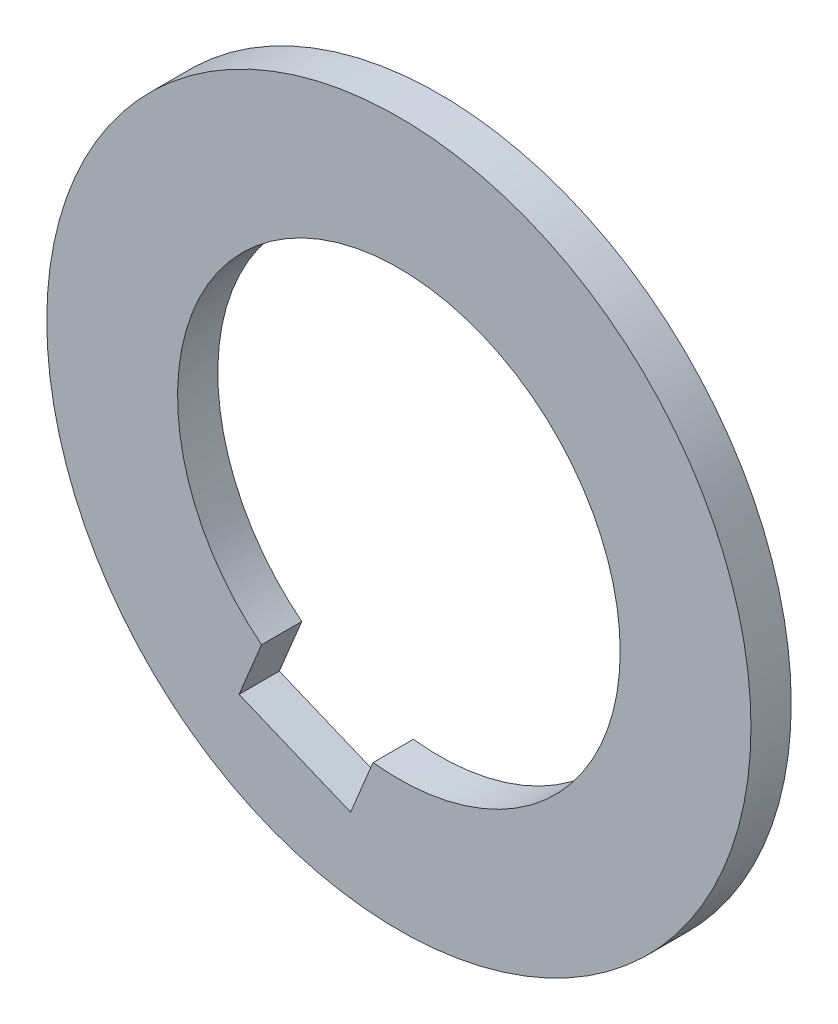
from build123d import *

# Parameters (mm, degrees)
SKETCH_1_R      = 17.5
EXTRUDE_1_DEPTH = 2


with BuildPart() as part:
    # Sketch 1 → Extrude 1 (new body)
    with BuildSketch(Plane.XY):
        Circle(SKETCH_1_R)
        with BuildLine():
            Line((-1.282625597, -10.924965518), (-2.399977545, -13.619475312))
            Line((-2.399977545, -13.619475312), (-7.942345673, -11.321181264))
            Line((-7.942345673, -11.321181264), (-6.824993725, -8.62667147))
            ThreePointArc((-6.824993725, -8.62667147), (4.213539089, 10.161008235), (-1.282625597, -10.924965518))
        make_face(mode=Mode.SUBTRACT)
    extrude(amount=EXTRUDE_1_DEPTH)


solid = part.part
